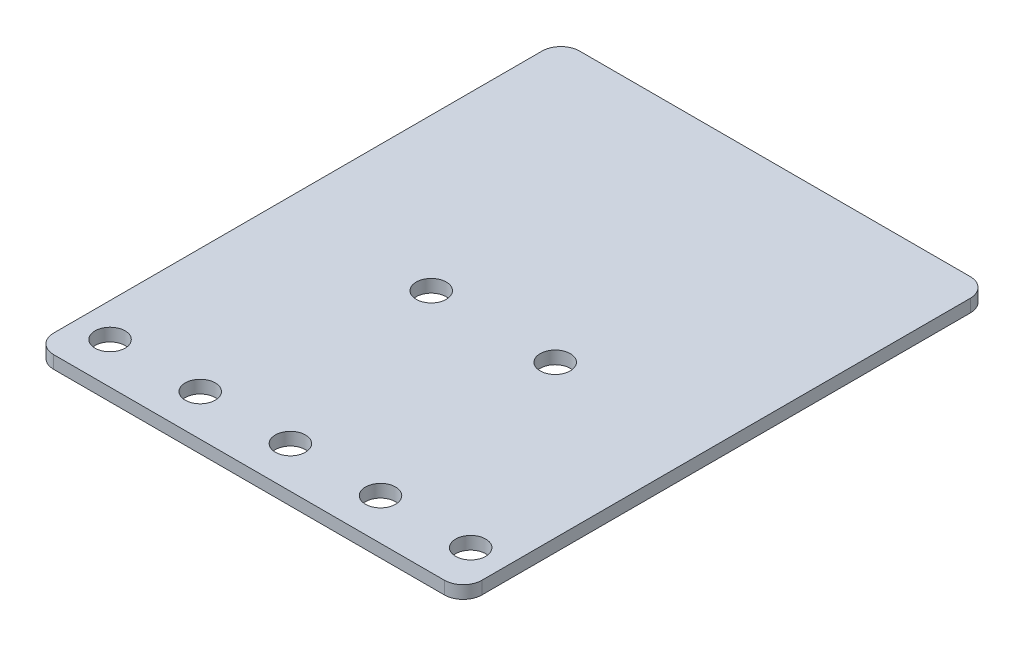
from build123d import *

# Parameters (mm, degrees)
ESQUISSE1_R        = 2
BOSS_EXTRU_1_DEPTH = 1.7


with BuildPart() as part:
    # Esquisse1 → Boss.-Extru.1 (new body)
    with BuildSketch(Plane(origin=(0, 0, 0), x_dir=(1, 0, 0), z_dir=(0, 1, 0))):
        with BuildLine():
            Line((-26, 35), (26, 35))
            ThreePointArc((26, 35), (27.767766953, 34.267766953), (28.5, 32.5))
            Line((28.5, 32.5), (28.5, -32.5))
            ThreePointArc((28.5, -32.5), (27.767766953, -34.267766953), (26, -35))
            Line((26, -35), (-26, -35))
            ThreePointArc((-26, -35), (-27.767766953, -34.267766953), (-28.5, -32.5))
            Line((-28.5, -32.5), (-28.5, 32.5))
            ThreePointArc((-28.5, 32.5), (-27.767766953, 34.267766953), (-26, 35))
        make_face()
        with Locations(Location((8.25, -2.5, 0), (0, 0, 270))):
            Circle(ESQUISSE1_R, mode=Mode.SUBTRACT)
        with Locations(Location((-8.25, -2.5, 0), (0, 0, 270))):
            Circle(ESQUISSE1_R, mode=Mode.SUBTRACT)
        with Locations(Location((0, -29.5, 0), (0, 0, 270))):
            Circle(ESQUISSE1_R, mode=Mode.SUBTRACT)
        with Locations(Location((12, -29.5, 0), (0, 0, 270))):
            Circle(ESQUISSE1_R, mode=Mode.SUBTRACT)
        with Locations(Location((24, -29.5, 0), (0, 0, 270))):
            Circle(ESQUISSE1_R, mode=Mode.SUBTRACT)
        with Locations(Location((-12, -29.5, 0), (0, 0, 270))):
            Circle(ESQUISSE1_R, mode=Mode.SUBTRACT)
        with Locations(Location((-24, -29.5, 0), (0, 0, 270))):
            Circle(ESQUISSE1_R, mode=Mode.SUBTRACT)
    extrude(amount=BOSS_EXTRU_1_DEPTH)


solid = part.part
